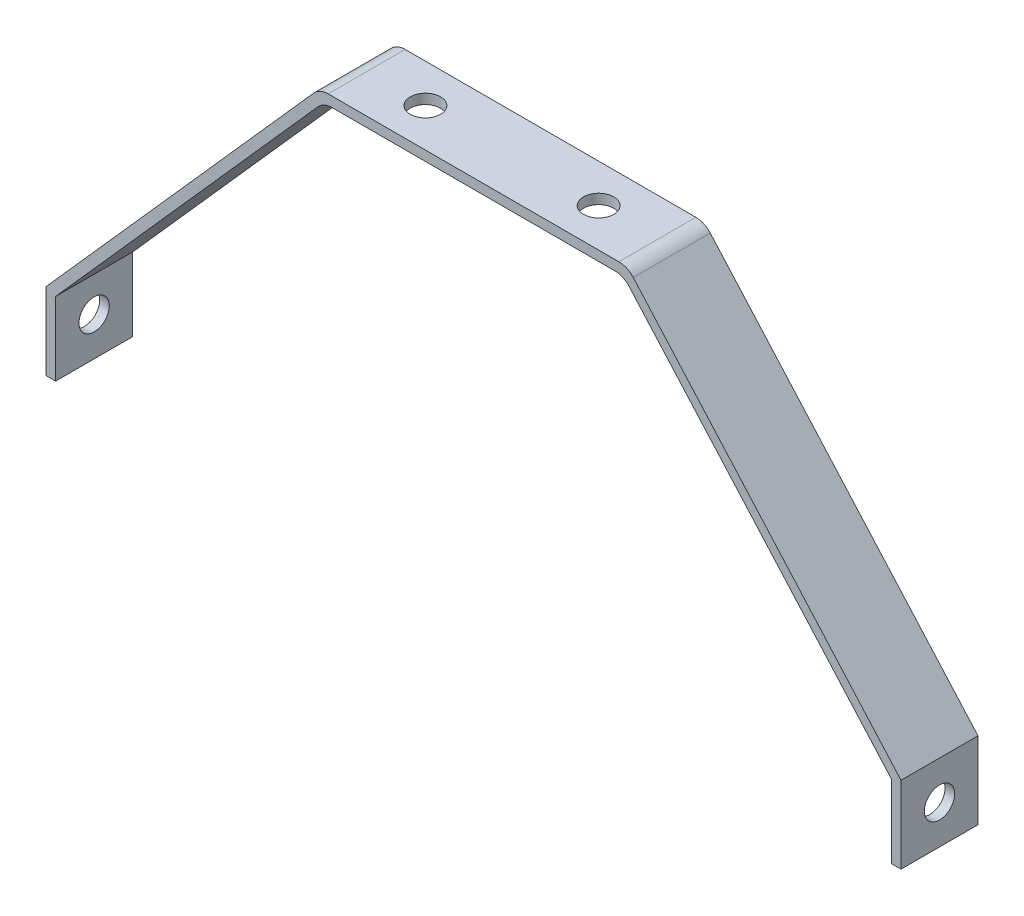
from build123d import *

# Parameters (mm, degrees)
BOSS_EXTRUDE3_DEPTH     = 25.4
CUT_EXTRUDE1_DEPTH      = 295.753806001
CUT_EXTRUDE1_DEPTH_BACK = 295.753806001
SKETCH2_R               = 5
CUT_EXTRUDE2_DEPTH      = 192.461844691
CUT_EXTRUDE2_DEPTH_BACK = 192.461844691
SKETCH4_R               = 5


with BuildPart() as part:
    # Sketch1 → Boss-Extrude3 (new body)
    with BuildSketch(Plane.XY):
        with BuildLine():
            Line((-141.008786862, -19.741987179), (-141.008786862, -45.141987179))
            Line((-141.008786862, -45.141987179), (-137.833786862, -45.141987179))
            Line((-137.833786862, -45.141987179), (-137.833786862, -20.94809739))
            Line((-137.833786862, -20.94809739), (-51.347860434, 76.458933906))
            ThreePointArc((-51.347860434, 76.458933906), (-49.202383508, 78.034887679), (-46.599437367, 78.592895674))
            Line((-46.599437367, 78.592895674), (46.599437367, 78.592895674))
            ThreePointArc((46.599437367, 78.592895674), (49.202383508, 78.034887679), (51.347860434, 76.458933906))
            Line((51.347860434, 76.458933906), (137.833786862, -20.94809739))
            Line((137.833786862, -20.94809739), (137.833786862, -45.141987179))
            Line((137.833786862, -45.141987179), (141.008786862, -45.141987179))
            Line((141.008786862, -45.141987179), (141.008786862, -19.741987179))
            Line((141.008786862, -19.741987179), (52.694705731, 79.724051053))
            ThreePointArc((52.694705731, 79.724051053), (50.549228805, 81.300004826), (47.946282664, 81.858012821))
            Line((47.946282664, 81.858012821), (-47.946282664, 81.858012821))
            ThreePointArc((-47.946282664, 81.858012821), (-50.549228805, 81.300004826), (-52.694705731, 79.724051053))
            Line((-52.694705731, 79.724051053), (-141.008786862, -19.741987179))
        make_face()
    extrude(amount=BOSS_EXTRUDE3_DEPTH)

    # Sketch2 → Cut-Extrude1 (cut, two sides: drawn at the far end of the back side and taken through both)
    with BuildSketch(Plane(origin=(141.008786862, 0, 0), x_dir=(0, 0, -1), z_dir=(1, 0, 0)).offset(-CUT_EXTRUDE1_DEPTH_BACK)):
        with Locations((-12.7, -32.441987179)):
            Circle(SKETCH2_R)
    extrude(amount=CUT_EXTRUDE1_DEPTH + CUT_EXTRUDE1_DEPTH_BACK, mode=Mode.SUBTRACT)

    # Sketch4 → Cut-Extrude2 (cut, two sides: drawn at the far end of the back side and taken through both)
    with BuildSketch(Plane(origin=(0, 81.858012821, 0), x_dir=(1, 0, 0), z_dir=(0, 1, 0)).offset(-CUT_EXTRUDE2_DEPTH_BACK)):
        with Locations(Location((-28.575, -12.7, 0), (0, 0, 270))):
            Circle(SKETCH4_R)
        with Locations(Location((28.575, -12.7, 0), (0, 0, 270))):
            Circle(SKETCH4_R)
    extrude(amount=CUT_EXTRUDE2_DEPTH + CUT_EXTRUDE2_DEPTH_BACK, mode=Mode.SUBTRACT)


solid = part.part
